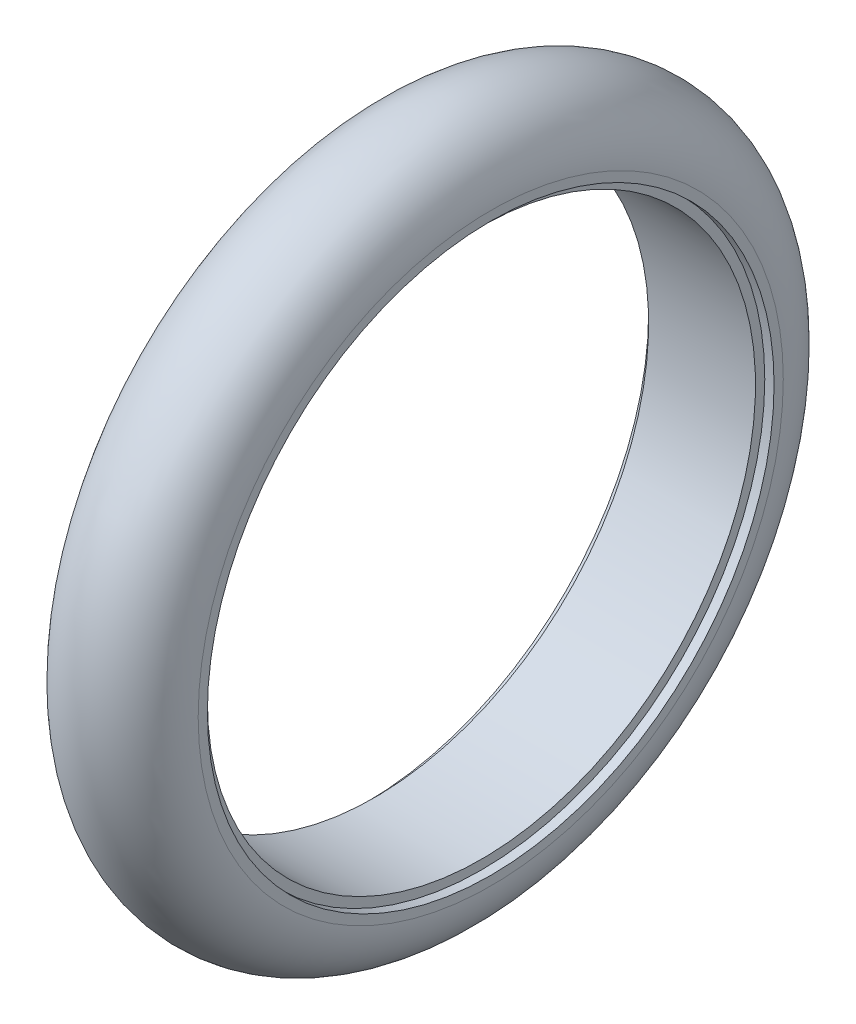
from build123d import *


with BuildPart() as part:
    # Sketch1 → Revolve2 (revolve)
    with BuildSketch(Plane.XY, mode=Mode.PRIVATE) as revolve2_sk:
        with BuildLine():
            Line((0, 29.5), (-5.75, 29.5))
            Line((-5.75, 29.5), (-5.75, 30.5))
            Line((-5.75, 30.5), (-6.75, 30.5))
            Line((-6.75, 30.5), (-6.75, 31.491830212))
            ThreePointArc((-6.75, 31.491830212), (0, 38.241830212), (6.75, 31.491830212))
            Line((6.75, 31.491830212), (6.75, 30.5))
            Line((6.75, 30.5), (5.75, 30.5))
            Line((5.75, 30.5), (5.75, 29.5))
            Line((5.75, 29.5), (0, 29.5))
        make_face()
    revolve(revolve2_sk.sketch.rotate(Axis((-39.280137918, 0, 0), (1, 0, 0)), 90), axis=Axis((-39.280137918, 0, 0), (1, 0, 0)))


solid = part.part
